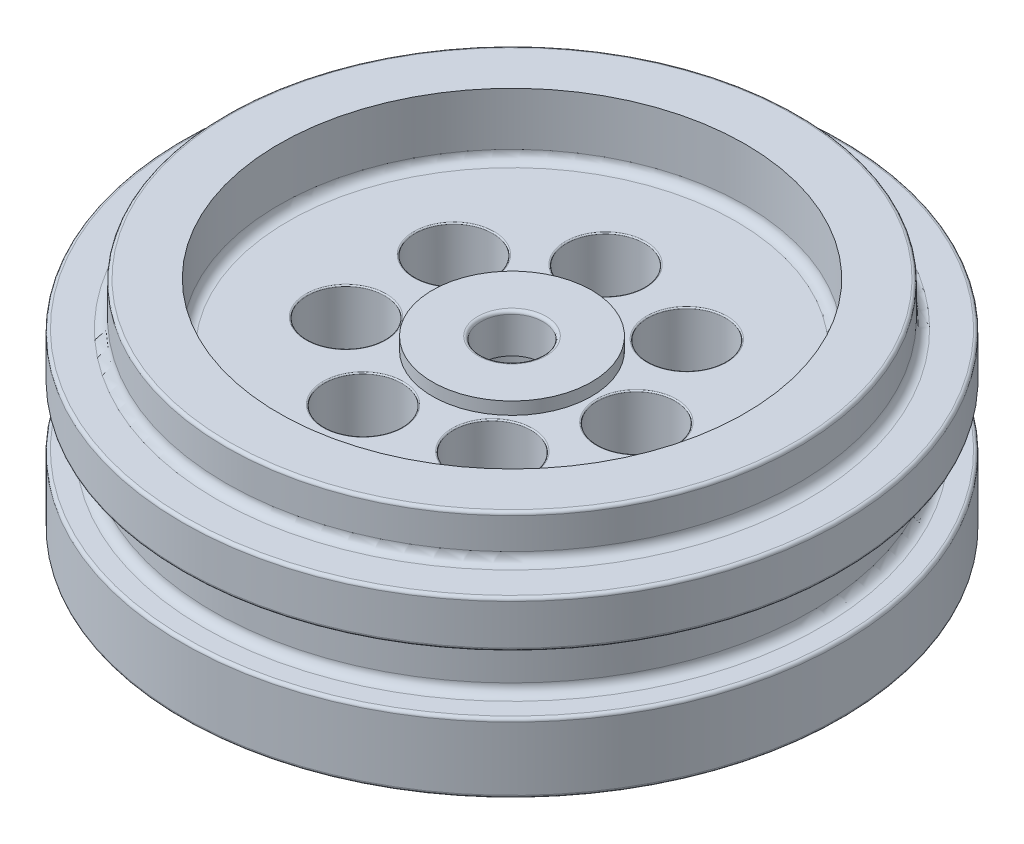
from build123d import *

# Parameters (mm, degrees)
SKETCH4_W                    = 6.2738
SKETCH4_H                    = 2.54
SKETCH5_W                    = 2.239058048
SKETCH5_H                    = 1.3208
SKETCH6_W                    = 1.2446
SKETCH6_H                    = 2.3622
SKETCH9_R                    = 6.985
CUT_EXTRUDE1_DEPTH           = 2.54
F_1_8_0_125_DIAMETER_HOLE1_D = 3.175
CIRPATTERN1_COUNT            = 7
LEADIN_RADIUS_R              = 0.127
DRAFT1_ANGLE                 = -24
ORING1_GLAND_RADIUS_R        = 0.381
ORING1_OPENING_RADIUS_R      = 0.127
ORING2_GLAND_RADIUS_R        = 0.381
ORING2_OPENING_RADIUS_R      = 0.127
FILLET1_R                    = 0.0508
FILLET2_R                    = 0.381
FILLET3_R                    = 0.127


with BuildPart() as part:
    # Sketch2 → Revolve1 (revolve)
    with BuildSketch(Plane.XY, mode=Mode.PRIVATE) as revolve1_sk:
        Polygon((11.684, 8.89), (0, 8.89), (0, 0), (13.462, 0), (13.462, 7.112), (11.684, 7.112), align=None)
    revolve(revolve1_sk.sketch.rotate(Axis((0, 0, 0), (0, 1, 0)), 90), axis=Axis((0, 0, 0), (0, 1, 0)))

    # Sketch3 → Cut-Revolve1 (revolve, cut)
    with BuildSketch(Plane.XY, mode=Mode.PRIVATE) as cut_revolve1_sk:
        Polygon((2.159, 5.2578), (2.159, 0), (0, 0), (0, 8.89), (3.2512, 8.89), (3.2512, 6.858), (1.27, 6.858), (1.27, 5.2578), align=None)
    revolve(cut_revolve1_sk.sketch.rotate(Axis((0, 0, 0), (0, 1, 0)), 90), axis=Axis((0, 0, 0), (0, 1, 0)), mode=Mode.SUBTRACT)

    # Sketch4 → Cut-Revolve2 (revolve, cut)
    with BuildSketch(Plane.XY, mode=Mode.PRIVATE) as cut_revolve2_sk:
        with Locations((6.3881, 7.62)):
            Rectangle(SKETCH4_W, SKETCH4_H)
    revolve(cut_revolve2_sk.sketch.rotate(Axis((0, 0, 0), (0, 1, 0)), 90), axis=Axis((0, 0, 0), (0, 1, 0)), mode=Mode.SUBTRACT)

    # Sketch5 → Cut-Revolve3 (revolve, cut)
    with BuildSketch(Plane.XY, mode=Mode.PRIVATE) as cut_revolve3_sk:
        with Locations((10.2743, 0.6604)):
            Rectangle(SKETCH5_W, SKETCH5_H)
    revolve(cut_revolve3_sk.sketch.rotate(Axis((0, 0, 0), (0, 1, 0)), 90), axis=Axis((0, 0, 0), (0, 1, 0)), mode=Mode.SUBTRACT)

    # Sketch6 → Cut-Revolve4 (revolve, cut)
    with BuildSketch(Plane.XY, mode=Mode.PRIVATE) as cut_revolve4_sk:
        with Locations((12.8397, 4.023377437)):
            Rectangle(SKETCH6_W, SKETCH6_H)
    revolve(cut_revolve4_sk.sketch.rotate(Axis((0, 0, 0), (0, 1, 0)), 90), axis=Axis((0, 0, 0), (0, 1, 0)), mode=Mode.SUBTRACT)

    # Sketch9 → Cut-Extrude1 (cut)
    with BuildSketch(Plane(origin=(0, 0, 0), x_dir=(1, 0, 0), z_dir=(0, 1, 0))):
        with Locations(Location((0, 0, 0), (0, 0, 270))):
            Circle(SKETCH9_R)
    extrude(amount=CUT_EXTRUDE1_DEPTH, mode=Mode.SUBTRACT)

    # 1_8 _0.125_ Diameter Hole1 (through all)
    with Locations(Plane.XZ):
        with Locations((5.08, 0)):
            f_1_8_0_125_diameter_hole1 = Hole(F_1_8_0_125_DIAMETER_HOLE1_D / 2)

    # CirPattern1: 1_8 _0.125_ Diameter Hole1 ×7 about axis
    cirpattern1_axis = Axis((0, 0, 0), (0, 1, 0))
    for i in range(1, CIRPATTERN1_COUNT):
        add(f_1_8_0_125_diameter_hole1.rotate(cirpattern1_axis, i * 360 / CIRPATTERN1_COUNT), mode=Mode.SUBTRACT)

    # leadin_radius
    leadin_radius_edges = [part.edges().sort_by_distance(p)[0] for p in [
        (0, 6.858, 1.27),
    ]]
    fillet(leadin_radius_edges, radius=LEADIN_RADIUS_R)

    # Draft1
    draft1_faces = [part.faces().sort_by_distance(p)[0] for p in [
        (0, 0.6604, 9.154770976),
    ]]
    draft(draft1_faces, Plane(origin=(11.393829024, 1.3208, 0), x_dir=(0, 0, -1), z_dir=(0, -1, 0)), DRAFT1_ANGLE)

    # oring1_gland_radius
    oring1_gland_radius_edges = [part.edges().sort_by_distance(p)[0] for p in [
        (0, 1.3208, 9.154770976),
        (0, 1.3208, 11.393829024),
    ]]
    fillet(oring1_gland_radius_edges, radius=ORING1_GLAND_RADIUS_R)

    # oring1_opening_radius
    oring1_opening_radius_edges = [part.edges().sort_by_distance(p)[0] for p in [
        (0, 0, 11.393829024),
        (0, 0, 9.742829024),
    ]]
    fillet(oring1_opening_radius_edges, radius=ORING1_OPENING_RADIUS_R)

    # oring2_gland_radius
    oring2_gland_radius_edges = [part.edges().sort_by_distance(p)[0] for p in [
        (0, 2.842277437, 12.2174),
        (0, 5.204477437, 12.2174),
    ]]
    fillet(oring2_gland_radius_edges, radius=ORING2_GLAND_RADIUS_R)

    # oring2_opening_radius
    oring2_opening_radius_edges = [part.edges().sort_by_distance(p)[0] for p in [
        (0, 5.204477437, 13.462),
        (0, 2.842277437, 13.462),
    ]]
    fillet(oring2_opening_radius_edges, radius=ORING2_OPENING_RADIUS_R)

    # Fillet1
    fillet1_edges = [part.edges().sort_by_distance(p)[0] for p in [
        (-1.483658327, 6.35, -6.500331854),
        (4.157118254, 6.35, -5.212861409),
        (6.6675, 6.35, 0),
        (4.157118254, 6.35, 5.212861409),
        (-1.483658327, 6.35, 6.500331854),
        (-6.007209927, 6.35, 2.892919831),
        (-6.007209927, 6.35, -2.892919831),
    ]]
    fillet(fillet1_edges, radius=FILLET1_R)

    # Fillet2
    fillet2_edges = [part.edges().sort_by_distance(p)[0] for p in [
        (0, 6.35, 9.525),
        (0, 7.112, 11.684),
    ]]
    fillet(fillet2_edges, radius=FILLET2_R)

    # Fillet3
    fillet3_edges = [part.edges().sort_by_distance(p)[0] for p in [
        (0, 7.112, 13.462),
        (0, 0, 13.462),
        (0, 8.89, 11.684),
    ]]
    fillet(fillet3_edges, radius=FILLET3_R)


solid = part.part
